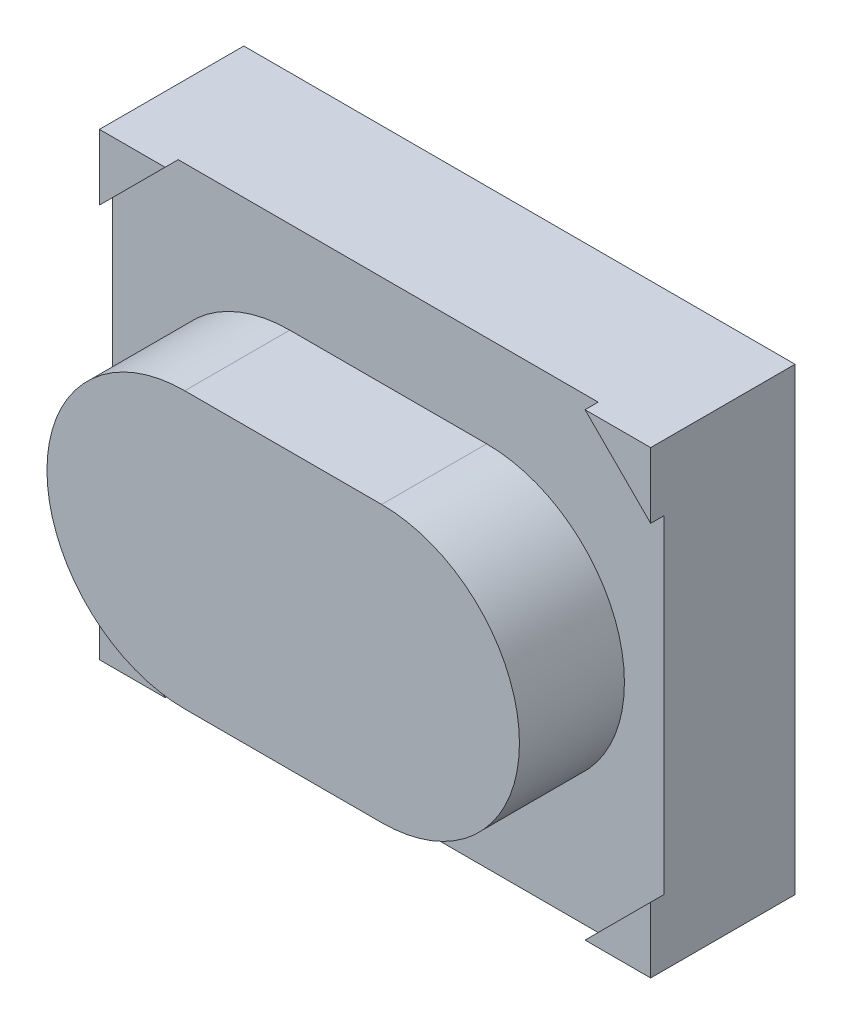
from build123d import *

# Parameters (mm, degrees)
SKETCH_1_W      = 4.2
SKETCH_1_H      = 3.5
EXTRUDE_1_DEPTH = 1
EXTRUDE_2_DEPTH = 0.1
EXTRUDE_3_DEPTH = 0.8


with BuildPart() as part:
    # Sketch 1 → Extrude 1 (new body)
    with BuildSketch(Plane.XY):
        Rectangle(SKETCH_1_W, SKETCH_1_H)
    extrude(amount=EXTRUDE_1_DEPTH)

    # Sketch 2 → Extrude 2 (add)
    with BuildSketch(Plane.XY.offset(1)):
        Polygon((-2.1, 1.25), (-2.1, 1.75), (-1.6, 1.75), align=None)
        Polygon((1.6, 1.75), (2.1, 1.25), (2.1, 1.75), align=None)
        Polygon((2.1, -1.25), (2.1, -1.75), (1.6, -1.75), align=None)
        Polygon((-1.6, -1.75), (-2.1, -1.25), (-2.1, -1.75), align=None)
    extrude(amount=EXTRUDE_2_DEPTH)

    # Sketch 3 → Extrude 3 (add)
    with BuildSketch(Plane.XY.offset(1)):
        with BuildLine():
            Line((-0.75, 1.05), (0.75, 1.05))
            ThreePointArc((0.75, 1.05), (1.8, 0), (0.75, -1.05))
            Line((0.75, -1.05), (-0.75, -1.05))
            ThreePointArc((-0.75, -1.05), (-1.8, 0), (-0.75, 1.05))
        make_face()
    extrude(amount=EXTRUDE_3_DEPTH)


solid = part.part
